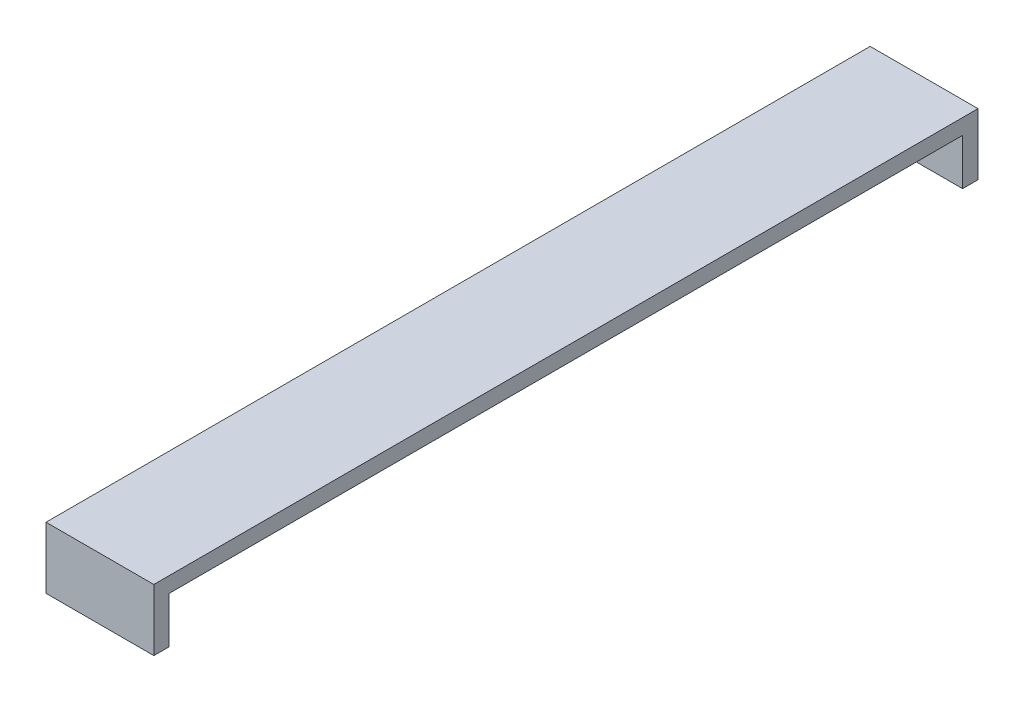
from build123d import *

# Parameters (mm, degrees)
SKICA1_W                = 7
SKICA1_H                = 1
P_IDAT_VYSUNUT_M1_DEPTH = 53.5
SKICA2_W                = 7
SKICA2_H                = 1
P_IDAT_VYSUNUT_M2_DEPTH = 3


with BuildPart() as part:
    # Skica1 → P_idat vysunut_m1 (new body)
    with BuildSketch(Plane.XY):
        with Locations((0, 0.5)):
            Rectangle(SKICA1_W, SKICA1_H)
    extrude(amount=P_IDAT_VYSUNUT_M1_DEPTH)

    # Skica2 → P_idat vysunut_m2 (add)
    with BuildSketch(Plane.XZ):
        with Locations((0, 53)):
            Rectangle(SKICA2_W, SKICA2_H)
        with Locations((0, 0.5)):
            Rectangle(SKICA2_W, SKICA2_H)
    extrude(amount=P_IDAT_VYSUNUT_M2_DEPTH)


solid = part.part
